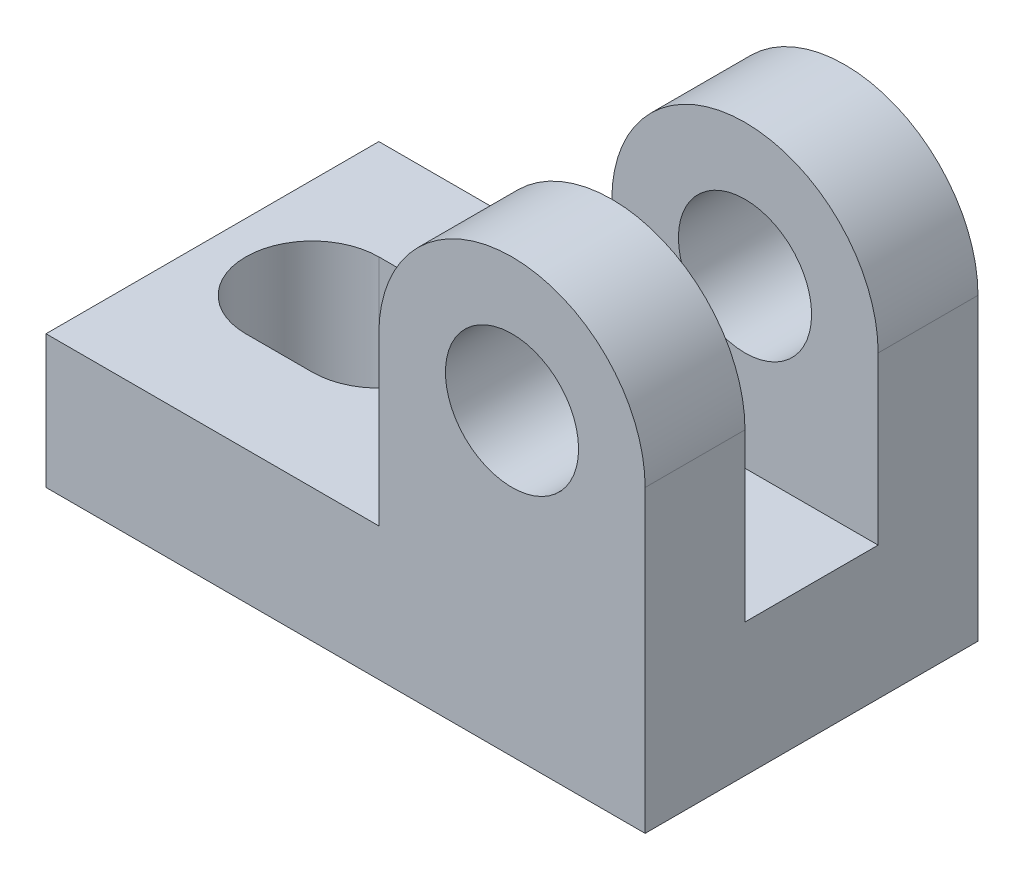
ISO-10303-21;
HEADER;
FILE_DESCRIPTION(('STEP AP214'),'2;1');
FILE_NAME('part.step','',(''),(''),'','','');
FILE_SCHEMA(('AUTOMOTIVE_DESIGN { 1 0 10303 214 1 1 1 1 }'));
ENDSEC;
DATA;
#1=APPLICATION_CONTEXT('core data for automotive mechanical design processes');
#2=APPLICATION_PROTOCOL_DEFINITION('international standard','automotive_design',2000,#1);
#3=PRODUCT_CONTEXT('',#1,'mechanical');
#4=PRODUCT('Part','Part','',(#3));
#5=PRODUCT_RELATED_PRODUCT_CATEGORY('part','',(#4));
#6=PRODUCT_DEFINITION_FORMATION('','',#4);
#7=PRODUCT_DEFINITION_CONTEXT('part definition',#1,'design');
#8=PRODUCT_DEFINITION('design','',#6,#7);
#9=PRODUCT_DEFINITION_SHAPE('','',#8);
#10=(LENGTH_UNIT() NAMED_UNIT(*) SI_UNIT(.MILLI.,.METRE.));
#11=(NAMED_UNIT(*) PLANE_ANGLE_UNIT() SI_UNIT($,.RADIAN.));
#12=(NAMED_UNIT(*) SI_UNIT($,.STERADIAN.) SOLID_ANGLE_UNIT());
#13=UNCERTAINTY_MEASURE_WITH_UNIT(LENGTH_MEASURE(1.E-05),#10,'distance_accuracy_value','');
#14=(GEOMETRIC_REPRESENTATION_CONTEXT(3) GLOBAL_UNCERTAINTY_ASSIGNED_CONTEXT((#13)) GLOBAL_UNIT_ASSIGNED_CONTEXT((#10,
#11,#12)) REPRESENTATION_CONTEXT('',''));
#15=CARTESIAN_POINT('',(0.,0.,0.));
#16=DIRECTION('',(0.,0.,1.));
#17=DIRECTION('',(1.,0.,0.));
#18=AXIS2_PLACEMENT_3D('',#15,#16,#17);
#19=CARTESIAN_POINT('',(70.,45.,-110.207972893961));
#20=DIRECTION('',(0.,0.,1.));
#21=DIRECTION('',(1.,0.,0.));
#22=AXIS2_PLACEMENT_3D('',#19,#20,#21);
#23=CYLINDRICAL_SURFACE('',#22,20.);
#24=CARTESIAN_POINT('',(70.,45.,-15.));
#25=DIRECTION('',(0.,0.,1.));
#26=DIRECTION('',(1.,0.,0.));
#27=AXIS2_PLACEMENT_3D('',#24,#25,#26);
#28=CIRCLE('',#27,20.);
#29=CARTESIAN_POINT('',(50.,45.,-15.));
#30=VERTEX_POINT('',#29);
#31=CARTESIAN_POINT('',(90.,45.,-15.));
#32=VERTEX_POINT('',#31);
#33=EDGE_CURVE('E166',#30,#32,#28,.F.);
#34=ORIENTED_EDGE('',*,*,#33,.F.);
#35=DIRECTION('',(0.,0.,1.));
#36=VECTOR('',#35,1.);
#37=CARTESIAN_POINT('',(50.,45.,-110.207972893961));
#38=LINE('',#37,#36);
#39=CARTESIAN_POINT('',(50.,45.,0.));
#40=VERTEX_POINT('',#39);
#41=EDGE_CURVE('E244',#30,#40,#38,.T.);
#42=ORIENTED_EDGE('',*,*,#41,.T.);
#43=CARTESIAN_POINT('',(70.,45.,0.));
#44=DIRECTION('',(0.,0.,1.));
#45=DIRECTION('',(-1.,0.,0.));
#46=AXIS2_PLACEMENT_3D('',#43,#44,#45);
#47=CIRCLE('',#46,20.);
#48=CARTESIAN_POINT('',(90.,45.,0.));
#49=VERTEX_POINT('',#48);
#50=EDGE_CURVE('E175',#49,#40,#47,.T.);
#51=ORIENTED_EDGE('',*,*,#50,.F.);
#52=DIRECTION('',(0.,0.,1.));
#53=VECTOR('',#52,1.);
#54=CARTESIAN_POINT('',(90.,45.,-110.207972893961));
#55=LINE('',#54,#53);
#56=EDGE_CURVE('E191',#32,#49,#55,.T.);
#57=ORIENTED_EDGE('',*,*,#56,.F.);
#58=EDGE_LOOP('',(#34,#42,#51,#57));
#59=FACE_BOUND('',#58,.T.);
#60=ADVANCED_FACE('F31',(#59),#23,.T.);
#61=CARTESIAN_POINT('',(50.,20.,-110.207972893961));
#62=DIRECTION('',(-1.,0.,0.));
#63=DIRECTION('',(0.,0.,1.));
#64=AXIS2_PLACEMENT_3D('',#61,#62,#63);
#65=PLANE('',#64);
#66=DIRECTION('',(0.,1.,0.));
#67=VECTOR('',#66,1.);
#68=CARTESIAN_POINT('',(50.,20.,-15.));
#69=LINE('',#68,#67);
#70=CARTESIAN_POINT('',(50.,20.,-15.));
#71=VERTEX_POINT('',#70);
#72=EDGE_CURVE('E163',#71,#30,#69,.T.);
#73=ORIENTED_EDGE('',*,*,#72,.F.);
#74=DIRECTION('',(0.,0.,1.));
#75=VECTOR('',#74,1.);
#76=CARTESIAN_POINT('',(50.,20.,-110.207972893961));
#77=LINE('',#76,#75);
#78=CARTESIAN_POINT('',(50.,20.,0.));
#79=VERTEX_POINT('',#78);
#80=EDGE_CURVE('E35',#71,#79,#77,.T.);
#81=ORIENTED_EDGE('',*,*,#80,.T.);
#82=DIRECTION('',(0.,-1.,0.));
#83=VECTOR('',#82,1.);
#84=CARTESIAN_POINT('',(50.,20.,0.));
#85=LINE('',#84,#83);
#86=EDGE_CURVE('E177',#40,#79,#85,.T.);
#87=ORIENTED_EDGE('',*,*,#86,.F.);
#88=ORIENTED_EDGE('',*,*,#41,.F.);
#89=EDGE_LOOP('',(#73,#81,#87,#88));
#90=FACE_BOUND('',#89,.T.);
#91=ADVANCED_FACE('F219',(#90),#65,.T.);
#92=CARTESIAN_POINT('',(70.,45.,-110.207972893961));
#93=DIRECTION('',(0.,0.,1.));
#94=DIRECTION('',(1.,0.,0.));
#95=AXIS2_PLACEMENT_3D('',#92,#93,#94);
#96=CYLINDRICAL_SURFACE('',#95,9.99999999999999);
#97=CARTESIAN_POINT('',(70.,45.,-15.));
#98=DIRECTION('',(0.,0.,1.));
#99=DIRECTION('',(1.,0.,0.));
#100=AXIS2_PLACEMENT_3D('',#97,#98,#99);
#101=CIRCLE('',#100,9.99999999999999);
#102=CARTESIAN_POINT('',(80.,45.,-15.));
#103=VERTEX_POINT('',#102);
#104=EDGE_CURVE('E162',#103,#103,#101,.F.);
#105=ORIENTED_EDGE('',*,*,#104,.T.);
#106=EDGE_LOOP('',(#105));
#107=FACE_BOUND('',#106,.T.);
#108=CARTESIAN_POINT('',(70.,45.,0.));
#109=DIRECTION('',(0.,0.,1.));
#110=DIRECTION('',(1.,0.,0.));
#111=AXIS2_PLACEMENT_3D('',#108,#109,#110);
#112=CIRCLE('',#111,9.99999999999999);
#113=CARTESIAN_POINT('',(80.,45.,0.));
#114=VERTEX_POINT('',#113);
#115=EDGE_CURVE('E168',#114,#114,#112,.T.);
#116=ORIENTED_EDGE('',*,*,#115,.T.);
#117=EDGE_LOOP('',(#116));
#118=FACE_BOUND('',#117,.T.);
#119=ADVANCED_FACE('F202',(#107,#118),#96,.F.);
#120=CARTESIAN_POINT('',(0.,20.,-50.));
#121=DIRECTION('',(0.,-1.,0.));
#122=DIRECTION('',(0.,0.,-1.));
#123=AXIS2_PLACEMENT_3D('',#120,#121,#122);
#124=PLANE('',#123);
#125=CARTESIAN_POINT('',(25.,20.,-25.));
#126=DIRECTION('',(0.,1.,0.));
#127=DIRECTION('',(0.,0.,1.));
#128=AXIS2_PLACEMENT_3D('',#125,#126,#127);
#129=CIRCLE('',#128,10.);
#130=CARTESIAN_POINT('',(25.,20.,-15.));
#131=VERTEX_POINT('',#130);
#132=CARTESIAN_POINT('',(25.,20.,-35.));
#133=VERTEX_POINT('',#132);
#134=EDGE_CURVE('E269',#131,#133,#129,.T.);
#135=ORIENTED_EDGE('',*,*,#134,.F.);
#136=DIRECTION('',(1.,0.,0.));
#137=VECTOR('',#136,1.);
#138=CARTESIAN_POINT('',(15.,20.,-15.));
#139=LINE('',#138,#137);
#140=CARTESIAN_POINT('',(15.,20.,-15.));
#141=VERTEX_POINT('',#140);
#142=EDGE_CURVE('E266',#141,#131,#139,.T.);
#143=ORIENTED_EDGE('',*,*,#142,.F.);
#144=CARTESIAN_POINT('',(15.,20.,-25.));
#145=DIRECTION('',(0.,1.,0.));
#146=DIRECTION('',(0.,0.,-1.));
#147=AXIS2_PLACEMENT_3D('',#144,#145,#146);
#148=CIRCLE('',#147,10.);
#149=CARTESIAN_POINT('',(15.,20.,-35.));
#150=VERTEX_POINT('',#149);
#151=EDGE_CURVE('E250',#150,#141,#148,.T.);
#152=ORIENTED_EDGE('',*,*,#151,.F.);
#153=DIRECTION('',(-1.,0.,0.));
#154=VECTOR('',#153,1.);
#155=CARTESIAN_POINT('',(15.,20.,-35.));
#156=LINE('',#155,#154);
#157=EDGE_CURVE('E255',#133,#150,#156,.T.);
#158=ORIENTED_EDGE('',*,*,#157,.F.);
#159=EDGE_LOOP('',(#135,#143,#152,#158));
#160=FACE_BOUND('',#159,.T.);
#161=DIRECTION('',(0.,0.,1.));
#162=VECTOR('',#161,1.);
#163=CARTESIAN_POINT('',(0.,20.,0.));
#164=LINE('',#163,#162);
#165=CARTESIAN_POINT('',(0.,20.,-50.));
#166=VERTEX_POINT('',#165);
#167=CARTESIAN_POINT('',(0.,20.,0.));
#168=VERTEX_POINT('',#167);
#169=EDGE_CURVE('E283',#166,#168,#164,.T.);
#170=ORIENTED_EDGE('',*,*,#169,.T.);
#171=DIRECTION('',(1.,0.,0.));
#172=VECTOR('',#171,1.);
#173=CARTESIAN_POINT('',(0.,20.,0.));
#174=LINE('',#173,#172);
#175=EDGE_CURVE('E285',#168,#79,#174,.T.);
#176=ORIENTED_EDGE('',*,*,#175,.T.);
#177=ORIENTED_EDGE('',*,*,#80,.F.);
#178=DIRECTION('',(1.,0.,0.));
#179=VECTOR('',#178,1.);
#180=CARTESIAN_POINT('',(-2.50000000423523E-05,20.,-15.));
#181=LINE('',#180,#179);
#182=CARTESIAN_POINT('',(90.,20.,-15.));
#183=VERTEX_POINT('',#182);
#184=EDGE_CURVE('E140',#71,#183,#181,.T.);
#185=ORIENTED_EDGE('',*,*,#184,.T.);
#186=DIRECTION('',(0.,0.,-1.));
#187=VECTOR('',#186,1.);
#188=CARTESIAN_POINT('',(90.,20.,-35.));
#189=LINE('',#188,#187);
#190=CARTESIAN_POINT('',(90.,20.,-35.));
#191=VERTEX_POINT('',#190);
#192=EDGE_CURVE('E144',#183,#191,#189,.T.);
#193=ORIENTED_EDGE('',*,*,#192,.T.);
#194=DIRECTION('',(1.,0.,0.));
#195=VECTOR('',#194,1.);
#196=CARTESIAN_POINT('',(-2.50000000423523E-05,20.,-35.));
#197=LINE('',#196,#195);
#198=CARTESIAN_POINT('',(50.,20.,-35.));
#199=VERTEX_POINT('',#198);
#200=EDGE_CURVE('E133',#199,#191,#197,.T.);
#201=ORIENTED_EDGE('',*,*,#200,.F.);
#202=CARTESIAN_POINT('',(50.,20.,-50.));
#203=VERTEX_POINT('',#202);
#204=EDGE_CURVE('E57',#203,#199,#77,.T.);
#205=ORIENTED_EDGE('',*,*,#204,.F.);
#206=DIRECTION('',(-1.,0.,0.));
#207=VECTOR('',#206,1.);
#208=CARTESIAN_POINT('',(0.,20.,-50.));
#209=LINE('',#208,#207);
#210=EDGE_CURVE('E186',#203,#166,#209,.T.);
#211=ORIENTED_EDGE('',*,*,#210,.T.);
#212=EDGE_LOOP('',(#170,#176,#177,#185,#193,#201,#205,#211));
#213=FACE_BOUND('',#212,.T.);
#214=ADVANCED_FACE('F145',(#160,#213),#124,.F.);
#215=CARTESIAN_POINT('',(0.,20.,0.));
#216=DIRECTION('',(1.,0.,0.));
#217=DIRECTION('',(0.,0.,-1.));
#218=AXIS2_PLACEMENT_3D('',#215,#216,#217);
#219=PLANE('',#218);
#220=DIRECTION('',(0.,0.,1.));
#221=VECTOR('',#220,1.);
#222=CARTESIAN_POINT('',(0.,0.,0.));
#223=LINE('',#222,#221);
#224=CARTESIAN_POINT('',(0.,0.,-50.));
#225=VERTEX_POINT('',#224);
#226=CARTESIAN_POINT('',(0.,0.,0.));
#227=VERTEX_POINT('',#226);
#228=EDGE_CURVE('E276',#225,#227,#223,.T.);
#229=ORIENTED_EDGE('',*,*,#228,.T.);
#230=DIRECTION('',(0.,-1.,0.));
#231=VECTOR('',#230,1.);
#232=CARTESIAN_POINT('',(0.,20.,0.));
#233=LINE('',#232,#231);
#234=EDGE_CURVE('E11',#168,#227,#233,.T.);
#235=ORIENTED_EDGE('',*,*,#234,.F.);
#236=ORIENTED_EDGE('',*,*,#169,.F.);
#237=DIRECTION('',(0.,-1.,0.));
#238=VECTOR('',#237,1.);
#239=CARTESIAN_POINT('',(0.,20.,-50.));
#240=LINE('',#239,#238);
#241=EDGE_CURVE('E297',#166,#225,#240,.T.);
#242=ORIENTED_EDGE('',*,*,#241,.T.);
#243=EDGE_LOOP('',(#229,#235,#236,#242));
#244=FACE_BOUND('',#243,.T.);
#245=ADVANCED_FACE('F33',(#244),#219,.F.);
#246=CARTESIAN_POINT('',(0.,20.,0.));
#247=DIRECTION('',(0.,0.,-1.));
#248=DIRECTION('',(-1.,0.,0.));
#249=AXIS2_PLACEMENT_3D('',#246,#247,#248);
#250=PLANE('',#249);
#251=DIRECTION('',(1.,0.,0.));
#252=VECTOR('',#251,1.);
#253=CARTESIAN_POINT('',(0.,0.,0.));
#254=LINE('',#253,#252);
#255=CARTESIAN_POINT('',(90.,0.,0.));
#256=VERTEX_POINT('',#255);
#257=EDGE_CURVE('E303',#227,#256,#254,.T.);
#258=ORIENTED_EDGE('',*,*,#257,.T.);
#259=DIRECTION('',(0.,-1.,0.));
#260=VECTOR('',#259,1.);
#261=CARTESIAN_POINT('',(90.,20.,0.));
#262=LINE('',#261,#260);
#263=EDGE_CURVE('E41',#49,#256,#262,.T.);
#264=ORIENTED_EDGE('',*,*,#263,.F.);
#265=ORIENTED_EDGE('',*,*,#50,.T.);
#266=ORIENTED_EDGE('',*,*,#86,.T.);
#267=ORIENTED_EDGE('',*,*,#175,.F.);
#268=ORIENTED_EDGE('',*,*,#234,.T.);
#269=EDGE_LOOP('',(#258,#264,#265,#266,#267,#268));
#270=FACE_BOUND('',#269,.T.);
#271=ORIENTED_EDGE('',*,*,#115,.F.);
#272=EDGE_LOOP('',(#271));
#273=FACE_BOUND('',#272,.T.);
#274=ADVANCED_FACE('F317',(#270,#273),#250,.F.);
#275=CARTESIAN_POINT('',(90.,20.,0.));
#276=DIRECTION('',(-1.,0.,0.));
#277=DIRECTION('',(0.,0.,1.));
#278=AXIS2_PLACEMENT_3D('',#275,#276,#277);
#279=PLANE('',#278);
#280=ORIENTED_EDGE('',*,*,#192,.F.);
#281=DIRECTION('',(0.,-1.,0.));
#282=VECTOR('',#281,1.);
#283=CARTESIAN_POINT('',(90.,20.,-15.));
#284=LINE('',#283,#282);
#285=EDGE_CURVE('E141',#32,#183,#284,.T.);
#286=ORIENTED_EDGE('',*,*,#285,.F.);
#287=ORIENTED_EDGE('',*,*,#56,.T.);
#288=ORIENTED_EDGE('',*,*,#263,.T.);
#289=DIRECTION('',(0.,0.,-1.));
#290=VECTOR('',#289,1.);
#291=CARTESIAN_POINT('',(90.,0.,0.));
#292=LINE('',#291,#290);
#293=CARTESIAN_POINT('',(90.,0.,-50.));
#294=VERTEX_POINT('',#293);
#295=EDGE_CURVE('E301',#256,#294,#292,.T.);
#296=ORIENTED_EDGE('',*,*,#295,.T.);
#297=DIRECTION('',(0.,-1.,0.));
#298=VECTOR('',#297,1.);
#299=CARTESIAN_POINT('',(90.,20.,-50.));
#300=LINE('',#299,#298);
#301=CARTESIAN_POINT('',(90.,45.,-50.));
#302=VERTEX_POINT('',#301);
#303=EDGE_CURVE('E294',#302,#294,#300,.T.);
#304=ORIENTED_EDGE('',*,*,#303,.F.);
#305=CARTESIAN_POINT('',(90.,45.,-35.));
#306=VERTEX_POINT('',#305);
#307=EDGE_CURVE('E154',#302,#306,#55,.T.);
#308=ORIENTED_EDGE('',*,*,#307,.T.);
#309=DIRECTION('',(0.,1.,0.));
#310=VECTOR('',#309,1.);
#311=CARTESIAN_POINT('',(90.,65.,-35.));
#312=LINE('',#311,#310);
#313=EDGE_CURVE('E138',#191,#306,#312,.T.);
#314=ORIENTED_EDGE('',*,*,#313,.F.);
#315=EDGE_LOOP('',(#280,#286,#287,#288,#296,#304,#308,#314));
#316=FACE_BOUND('',#315,.T.);
#317=ADVANCED_FACE('F152',(#316),#279,.F.);
#318=CARTESIAN_POINT('',(0.,20.,-50.));
#319=DIRECTION('',(0.,0.,1.));
#320=DIRECTION('',(1.,0.,0.));
#321=AXIS2_PLACEMENT_3D('',#318,#319,#320);
#322=PLANE('',#321);
#323=DIRECTION('',(-1.,0.,0.));
#324=VECTOR('',#323,1.);
#325=CARTESIAN_POINT('',(0.,0.,-50.));
#326=LINE('',#325,#324);
#327=EDGE_CURVE('E286',#294,#225,#326,.T.);
#328=ORIENTED_EDGE('',*,*,#327,.T.);
#329=ORIENTED_EDGE('',*,*,#241,.F.);
#330=ORIENTED_EDGE('',*,*,#210,.F.);
#331=DIRECTION('',(0.,1.,0.));
#332=VECTOR('',#331,1.);
#333=CARTESIAN_POINT('',(50.,20.,-50.));
#334=LINE('',#333,#332);
#335=CARTESIAN_POINT('',(50.,45.,-50.));
#336=VERTEX_POINT('',#335);
#337=EDGE_CURVE('E172',#203,#336,#334,.T.);
#338=ORIENTED_EDGE('',*,*,#337,.T.);
#339=CARTESIAN_POINT('',(70.,45.,-50.));
#340=DIRECTION('',(0.,0.,1.));
#341=DIRECTION('',(1.,0.,0.));
#342=AXIS2_PLACEMENT_3D('',#339,#340,#341);
#343=CIRCLE('',#342,20.);
#344=EDGE_CURVE('E169',#336,#302,#343,.F.);
#345=ORIENTED_EDGE('',*,*,#344,.T.);
#346=ORIENTED_EDGE('',*,*,#303,.T.);
#347=EDGE_LOOP('',(#328,#329,#330,#338,#345,#346));
#348=FACE_BOUND('',#347,.T.);
#349=CARTESIAN_POINT('',(70.,45.,-50.));
#350=DIRECTION('',(0.,0.,1.));
#351=DIRECTION('',(1.,0.,0.));
#352=AXIS2_PLACEMENT_3D('',#349,#350,#351);
#353=CIRCLE('',#352,9.99999999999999);
#354=CARTESIAN_POINT('',(80.,45.,-50.));
#355=VERTEX_POINT('',#354);
#356=EDGE_CURVE('E195',#355,#355,#353,.F.);
#357=ORIENTED_EDGE('',*,*,#356,.F.);
#358=EDGE_LOOP('',(#357));
#359=FACE_BOUND('',#358,.T.);
#360=ADVANCED_FACE('F321',(#348,#359),#322,.F.);
#361=CARTESIAN_POINT('',(0.,0.,-50.));
#362=DIRECTION('',(0.,-1.,0.));
#363=DIRECTION('',(0.,0.,-1.));
#364=AXIS2_PLACEMENT_3D('',#361,#362,#363);
#365=PLANE('',#364);
#366=CARTESIAN_POINT('',(15.,0.,-25.));
#367=DIRECTION('',(0.,1.,0.));
#368=DIRECTION('',(0.,0.,-1.));
#369=AXIS2_PLACEMENT_3D('',#366,#367,#368);
#370=CIRCLE('',#369,10.);
#371=CARTESIAN_POINT('',(15.,0.,-35.));
#372=VERTEX_POINT('',#371);
#373=CARTESIAN_POINT('',(15.,0.,-15.));
#374=VERTEX_POINT('',#373);
#375=EDGE_CURVE('E251',#372,#374,#370,.T.);
#376=ORIENTED_EDGE('',*,*,#375,.T.);
#377=DIRECTION('',(1.,0.,0.));
#378=VECTOR('',#377,1.);
#379=CARTESIAN_POINT('',(15.,0.,-15.));
#380=LINE('',#379,#378);
#381=CARTESIAN_POINT('',(25.,0.,-15.));
#382=VERTEX_POINT('',#381);
#383=EDGE_CURVE('E254',#374,#382,#380,.T.);
#384=ORIENTED_EDGE('',*,*,#383,.T.);
#385=CARTESIAN_POINT('',(25.,0.,-25.));
#386=DIRECTION('',(0.,1.,0.));
#387=DIRECTION('',(0.,0.,1.));
#388=AXIS2_PLACEMENT_3D('',#385,#386,#387);
#389=CIRCLE('',#388,10.);
#390=CARTESIAN_POINT('',(25.,0.,-35.));
#391=VERTEX_POINT('',#390);
#392=EDGE_CURVE('E258',#382,#391,#389,.T.);
#393=ORIENTED_EDGE('',*,*,#392,.T.);
#394=DIRECTION('',(-1.,0.,0.));
#395=VECTOR('',#394,1.);
#396=CARTESIAN_POINT('',(15.,0.,-35.));
#397=LINE('',#396,#395);
#398=EDGE_CURVE('E261',#391,#372,#397,.T.);
#399=ORIENTED_EDGE('',*,*,#398,.T.);
#400=EDGE_LOOP('',(#376,#384,#393,#399));
#401=FACE_BOUND('',#400,.T.);
#402=ORIENTED_EDGE('',*,*,#228,.F.);
#403=ORIENTED_EDGE('',*,*,#327,.F.);
#404=ORIENTED_EDGE('',*,*,#295,.F.);
#405=ORIENTED_EDGE('',*,*,#257,.F.);
#406=EDGE_LOOP('',(#402,#403,#404,#405));
#407=FACE_BOUND('',#406,.T.);
#408=ADVANCED_FACE('F312',(#401,#407),#365,.T.);
#409=CARTESIAN_POINT('',(15.,0.,-25.));
#410=DIRECTION('',(0.,1.,0.));
#411=DIRECTION('',(0.,0.,1.));
#412=AXIS2_PLACEMENT_3D('',#409,#410,#411);
#413=CYLINDRICAL_SURFACE('',#412,10.);
#414=ORIENTED_EDGE('',*,*,#151,.T.);
#415=DIRECTION('',(0.,1.,0.));
#416=VECTOR('',#415,1.);
#417=CARTESIAN_POINT('',(15.,0.,-15.));
#418=LINE('',#417,#416);
#419=EDGE_CURVE('E264',#374,#141,#418,.T.);
#420=ORIENTED_EDGE('',*,*,#419,.F.);
#421=ORIENTED_EDGE('',*,*,#375,.F.);
#422=DIRECTION('',(0.,1.,0.));
#423=VECTOR('',#422,1.);
#424=CARTESIAN_POINT('',(15.,0.,-35.));
#425=LINE('',#424,#423);
#426=EDGE_CURVE('E274',#372,#150,#425,.T.);
#427=ORIENTED_EDGE('',*,*,#426,.T.);
#428=EDGE_LOOP('',(#414,#420,#421,#427));
#429=FACE_BOUND('',#428,.T.);
#430=ADVANCED_FACE('F333',(#429),#413,.F.);
#431=CARTESIAN_POINT('',(15.,0.,-35.));
#432=DIRECTION('',(0.,0.,-1.));
#433=DIRECTION('',(-1.,0.,0.));
#434=AXIS2_PLACEMENT_3D('',#431,#432,#433);
#435=PLANE('',#434);
#436=ORIENTED_EDGE('',*,*,#157,.T.);
#437=ORIENTED_EDGE('',*,*,#426,.F.);
#438=ORIENTED_EDGE('',*,*,#398,.F.);
#439=DIRECTION('',(0.,1.,0.));
#440=VECTOR('',#439,1.);
#441=CARTESIAN_POINT('',(25.,0.,-35.));
#442=LINE('',#441,#440);
#443=EDGE_CURVE('E277',#391,#133,#442,.T.);
#444=ORIENTED_EDGE('',*,*,#443,.T.);
#445=EDGE_LOOP('',(#436,#437,#438,#444));
#446=FACE_BOUND('',#445,.T.);
#447=ADVANCED_FACE('F352',(#446),#435,.F.);
#448=CARTESIAN_POINT('',(25.,0.,-25.));
#449=DIRECTION('',(0.,1.,0.));
#450=DIRECTION('',(0.,0.,1.));
#451=AXIS2_PLACEMENT_3D('',#448,#449,#450);
#452=CYLINDRICAL_SURFACE('',#451,10.);
#453=ORIENTED_EDGE('',*,*,#134,.T.);
#454=ORIENTED_EDGE('',*,*,#443,.F.);
#455=ORIENTED_EDGE('',*,*,#392,.F.);
#456=DIRECTION('',(0.,1.,0.));
#457=VECTOR('',#456,1.);
#458=CARTESIAN_POINT('',(25.,0.,-15.));
#459=LINE('',#458,#457);
#460=EDGE_CURVE('E279',#382,#131,#459,.T.);
#461=ORIENTED_EDGE('',*,*,#460,.T.);
#462=EDGE_LOOP('',(#453,#454,#455,#461));
#463=FACE_BOUND('',#462,.T.);
#464=ADVANCED_FACE('F237',(#463),#452,.F.);
#465=CARTESIAN_POINT('',(15.,0.,-15.));
#466=DIRECTION('',(0.,0.,1.));
#467=DIRECTION('',(1.,0.,0.));
#468=AXIS2_PLACEMENT_3D('',#465,#466,#467);
#469=PLANE('',#468);
#470=ORIENTED_EDGE('',*,*,#142,.T.);
#471=ORIENTED_EDGE('',*,*,#460,.F.);
#472=ORIENTED_EDGE('',*,*,#383,.F.);
#473=ORIENTED_EDGE('',*,*,#419,.T.);
#474=EDGE_LOOP('',(#470,#471,#472,#473));
#475=FACE_BOUND('',#474,.T.);
#476=ADVANCED_FACE('F230',(#475),#469,.F.);
#477=CARTESIAN_POINT('',(70.,45.,-35.));
#478=DIRECTION('',(0.,0.,-1.));
#479=DIRECTION('',(-1.,0.,0.));
#480=AXIS2_PLACEMENT_3D('',#477,#478,#479);
#481=CIRCLE('',#480,20.);
#482=CARTESIAN_POINT('',(50.,45.,-35.));
#483=VERTEX_POINT('',#482);
#484=EDGE_CURVE('E49',#306,#483,#481,.F.);
#485=ORIENTED_EDGE('',*,*,#484,.F.);
#486=ORIENTED_EDGE('',*,*,#307,.F.);
#487=ORIENTED_EDGE('',*,*,#344,.F.);
#488=EDGE_CURVE('E180',#336,#483,#38,.T.);
#489=ORIENTED_EDGE('',*,*,#488,.T.);
#490=EDGE_LOOP('',(#485,#486,#487,#489));
#491=FACE_BOUND('',#490,.T.);
#492=ADVANCED_FACE('F222',(#491),#23,.T.);
#493=DIRECTION('',(0.,-1.,0.));
#494=VECTOR('',#493,1.);
#495=CARTESIAN_POINT('',(50.,20.,-35.));
#496=LINE('',#495,#494);
#497=EDGE_CURVE('E139',#483,#199,#496,.T.);
#498=ORIENTED_EDGE('',*,*,#497,.F.);
#499=ORIENTED_EDGE('',*,*,#488,.F.);
#500=ORIENTED_EDGE('',*,*,#337,.F.);
#501=ORIENTED_EDGE('',*,*,#204,.T.);
#502=EDGE_LOOP('',(#498,#499,#500,#501));
#503=FACE_BOUND('',#502,.T.);
#504=ADVANCED_FACE('F215',(#503),#65,.T.);
#505=CARTESIAN_POINT('',(70.,45.,-35.));
#506=DIRECTION('',(0.,0.,-1.));
#507=DIRECTION('',(-1.,0.,0.));
#508=AXIS2_PLACEMENT_3D('',#505,#506,#507);
#509=CIRCLE('',#508,9.99999999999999);
#510=CARTESIAN_POINT('',(60.,45.,-35.));
#511=VERTEX_POINT('',#510);
#512=EDGE_CURVE('E158',#511,#511,#509,.F.);
#513=ORIENTED_EDGE('',*,*,#512,.T.);
#514=EDGE_LOOP('',(#513));
#515=FACE_BOUND('',#514,.T.);
#516=ORIENTED_EDGE('',*,*,#356,.T.);
#517=EDGE_LOOP('',(#516));
#518=FACE_BOUND('',#517,.T.);
#519=ADVANCED_FACE('F207',(#515,#518),#96,.F.);
#520=CARTESIAN_POINT('',(-2.50000000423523E-05,20.,-15.));
#521=DIRECTION('',(0.,0.,1.));
#522=DIRECTION('',(1.,0.,0.));
#523=AXIS2_PLACEMENT_3D('',#520,#521,#522);
#524=PLANE('',#523);
#525=ORIENTED_EDGE('',*,*,#33,.T.);
#526=ORIENTED_EDGE('',*,*,#285,.T.);
#527=ORIENTED_EDGE('',*,*,#184,.F.);
#528=ORIENTED_EDGE('',*,*,#72,.T.);
#529=EDGE_LOOP('',(#525,#526,#527,#528));
#530=FACE_BOUND('',#529,.T.);
#531=ORIENTED_EDGE('',*,*,#104,.F.);
#532=EDGE_LOOP('',(#531));
#533=FACE_BOUND('',#532,.T.);
#534=ADVANCED_FACE('F205',(#530,#533),#524,.F.);
#535=CARTESIAN_POINT('',(-2.50000000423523E-05,65.,-35.));
#536=DIRECTION('',(0.,0.,-1.));
#537=DIRECTION('',(-1.,0.,0.));
#538=AXIS2_PLACEMENT_3D('',#535,#536,#537);
#539=PLANE('',#538);
#540=ORIENTED_EDGE('',*,*,#484,.T.);
#541=ORIENTED_EDGE('',*,*,#497,.T.);
#542=ORIENTED_EDGE('',*,*,#200,.T.);
#543=ORIENTED_EDGE('',*,*,#313,.T.);
#544=EDGE_LOOP('',(#540,#541,#542,#543));
#545=FACE_BOUND('',#544,.T.);
#546=ORIENTED_EDGE('',*,*,#512,.F.);
#547=EDGE_LOOP('',(#546));
#548=FACE_BOUND('',#547,.T.);
#549=ADVANCED_FACE('F135',(#545,#548),#539,.F.);
#550=CLOSED_SHELL('',(#60,#91,#119,#214,#245,#274,#317,#360,#408,#430,#447,#464,#476,#492,#504,
#519,#534,#549));
#551=MANIFOLD_SOLID_BREP('B2',#550);
#552=ADVANCED_BREP_SHAPE_REPRESENTATION('',(#18,#551),#14);
#553=SHAPE_DEFINITION_REPRESENTATION(#9,#552);
ENDSEC;
END-ISO-10303-21;
